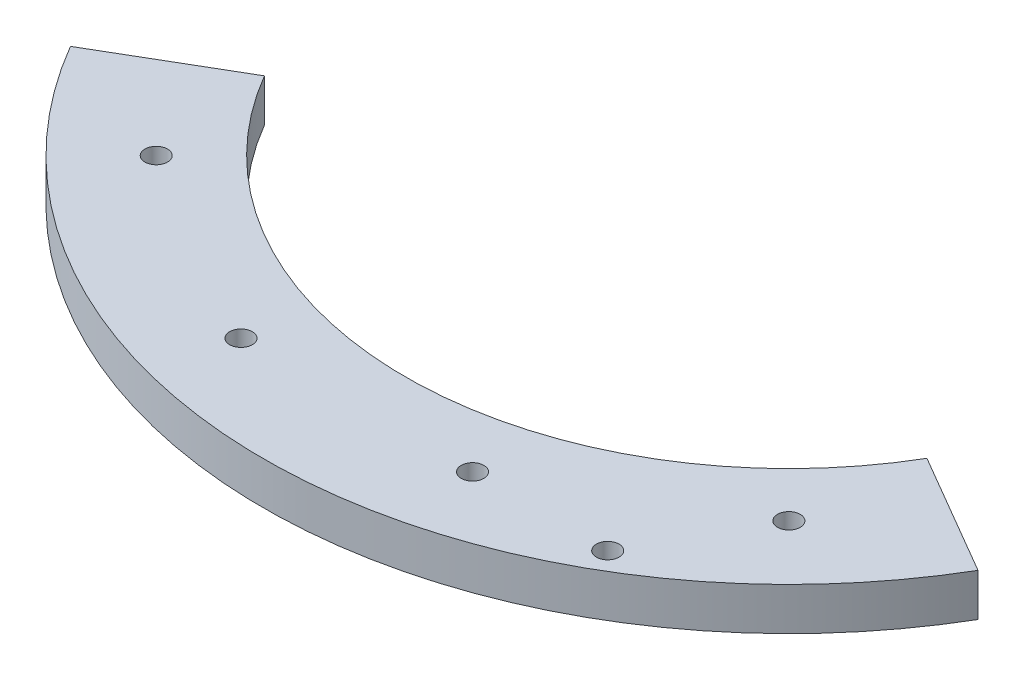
ISO-10303-21;
HEADER;
FILE_DESCRIPTION(('STEP AP214'),'2;1');
FILE_NAME('part.step','',(''),(''),'','','');
FILE_SCHEMA(('AUTOMOTIVE_DESIGN { 1 0 10303 214 1 1 1 1 }'));
ENDSEC;
DATA;
#1=APPLICATION_CONTEXT('core data for automotive mechanical design processes');
#2=APPLICATION_PROTOCOL_DEFINITION('international standard','automotive_design',2000,#1);
#3=PRODUCT_CONTEXT('',#1,'mechanical');
#4=PRODUCT('Part','Part','',(#3));
#5=PRODUCT_RELATED_PRODUCT_CATEGORY('part','',(#4));
#6=PRODUCT_DEFINITION_FORMATION('','',#4);
#7=PRODUCT_DEFINITION_CONTEXT('part definition',#1,'design');
#8=PRODUCT_DEFINITION('design','',#6,#7);
#9=PRODUCT_DEFINITION_SHAPE('','',#8);
#10=(LENGTH_UNIT() NAMED_UNIT(*) SI_UNIT(.MILLI.,.METRE.));
#11=(NAMED_UNIT(*) PLANE_ANGLE_UNIT() SI_UNIT($,.RADIAN.));
#12=(NAMED_UNIT(*) SI_UNIT($,.STERADIAN.) SOLID_ANGLE_UNIT());
#13=UNCERTAINTY_MEASURE_WITH_UNIT(LENGTH_MEASURE(1.E-05),#10,'distance_accuracy_value','');
#14=(GEOMETRIC_REPRESENTATION_CONTEXT(3) GLOBAL_UNCERTAINTY_ASSIGNED_CONTEXT((#13)) GLOBAL_UNIT_ASSIGNED_CONTEXT((#10,
#11,#12)) REPRESENTATION_CONTEXT('',''));
#15=CARTESIAN_POINT('',(0.,0.,0.));
#16=DIRECTION('',(0.,0.,1.));
#17=DIRECTION('',(1.,0.,0.));
#18=AXIS2_PLACEMENT_3D('',#15,#16,#17);
#19=CARTESIAN_POINT('',(0.,0.,0.));
#20=DIRECTION('',(0.,1.,0.));
#21=DIRECTION('',(0.,0.,1.));
#22=AXIS2_PLACEMENT_3D('',#19,#20,#21);
#23=PLANE('',#22);
#24=CARTESIAN_POINT('',(0.,0.,0.));
#25=DIRECTION('',(0.,1.,0.));
#26=DIRECTION('',(0.,0.,1.));
#27=AXIS2_PLACEMENT_3D('',#24,#25,#26);
#28=CIRCLE('',#27,154.051);
#29=CARTESIAN_POINT('',(133.074723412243,0.,77.60688493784));
#30=VERTEX_POINT('',#29);
#31=CARTESIAN_POINT('',(-133.074723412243,0.,77.60688493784));
#32=VERTEX_POINT('',#31);
#33=EDGE_CURVE('E11',#30,#32,#28,.F.);
#34=ORIENTED_EDGE('',*,*,#33,.F.);
#35=DIRECTION('',(-0.863835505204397,0.,-0.503773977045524));
#36=VECTOR('',#35,1.);
#37=CARTESIAN_POINT('',(98.7363982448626,0.,57.5813655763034));
#38=LINE('',#37,#36);
#39=CARTESIAN_POINT('',(135.268865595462,0.,78.8864708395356));
#40=VERTEX_POINT('',#39);
#41=EDGE_CURVE('E116',#40,#30,#38,.T.);
#42=ORIENTED_EDGE('',*,*,#41,.F.);
#43=CARTESIAN_POINT('',(0.,0.,0.));
#44=DIRECTION('',(0.,1.,0.));
#45=DIRECTION('',(0.,0.,1.));
#46=AXIS2_PLACEMENT_3D('',#43,#44,#45);
#47=CIRCLE('',#46,156.591);
#48=CARTESIAN_POINT('',(-135.268865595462,0.,78.8864708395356));
#49=VERTEX_POINT('',#48);
#50=EDGE_CURVE('E103',#49,#40,#47,.T.);
#51=ORIENTED_EDGE('',*,*,#50,.F.);
#52=DIRECTION('',(-0.863835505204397,0.,0.503773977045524));
#53=VECTOR('',#52,1.);
#54=CARTESIAN_POINT('',(-98.7363982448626,0.,57.5813655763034));
#55=LINE('',#54,#53);
#56=EDGE_CURVE('E113',#32,#49,#55,.T.);
#57=ORIENTED_EDGE('',*,*,#56,.F.);
#58=EDGE_LOOP('',(#34,#42,#51,#57));
#59=FACE_BOUND('',#58,.T.);
#60=ADVANCED_FACE('F36',(#59),#23,.F.);
#61=CARTESIAN_POINT('',(0.,12.7,0.));
#62=DIRECTION('',(0.,-1.,0.));
#63=DIRECTION('',(0.,0.,-1.));
#64=AXIS2_PLACEMENT_3D('',#61,#62,#63);
#65=CYLINDRICAL_SURFACE('',#64,156.591);
#66=ORIENTED_EDGE('',*,*,#50,.T.);
#67=DIRECTION('',(0.,-1.,0.));
#68=VECTOR('',#67,1.);
#69=CARTESIAN_POINT('',(135.268865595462,12.7,78.8864708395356));
#70=LINE('',#69,#68);
#71=CARTESIAN_POINT('',(135.268865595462,12.7,78.8864708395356));
#72=VERTEX_POINT('',#71);
#73=EDGE_CURVE('E45',#72,#40,#70,.T.);
#74=ORIENTED_EDGE('',*,*,#73,.F.);
#75=CARTESIAN_POINT('',(0.,12.7,0.));
#76=DIRECTION('',(0.,1.,0.));
#77=DIRECTION('',(0.,0.,1.));
#78=AXIS2_PLACEMENT_3D('',#75,#76,#77);
#79=CIRCLE('',#78,156.591);
#80=CARTESIAN_POINT('',(-135.268865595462,12.7,78.8864708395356));
#81=VERTEX_POINT('',#80);
#82=EDGE_CURVE('E91',#81,#72,#79,.T.);
#83=ORIENTED_EDGE('',*,*,#82,.F.);
#84=DIRECTION('',(0.,-1.,0.));
#85=VECTOR('',#84,1.);
#86=CARTESIAN_POINT('',(-135.268865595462,12.7,78.8864708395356));
#87=LINE('',#86,#85);
#88=EDGE_CURVE('E109',#81,#49,#87,.T.);
#89=ORIENTED_EDGE('',*,*,#88,.T.);
#90=EDGE_LOOP('',(#66,#74,#83,#89));
#91=FACE_BOUND('',#90,.T.);
#92=ADVANCED_FACE('F38',(#91),#65,.T.);
#93=CARTESIAN_POINT('',(98.7363982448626,12.7,57.5813655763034));
#94=DIRECTION('',(-0.503773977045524,0.,0.863835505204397));
#95=DIRECTION('',(0.863835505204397,0.,0.503773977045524));
#96=AXIS2_PLACEMENT_3D('',#93,#94,#95);
#97=PLANE('',#96);
#98=ORIENTED_EDGE('',*,*,#41,.T.);
#99=CARTESIAN_POINT('',(98.7363982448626,0.,57.5813655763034));
#100=VERTEX_POINT('',#99);
#101=EDGE_CURVE('E118',#30,#100,#38,.T.);
#102=ORIENTED_EDGE('',*,*,#101,.T.);
#103=DIRECTION('',(0.,-1.,0.));
#104=VECTOR('',#103,1.);
#105=CARTESIAN_POINT('',(98.7363982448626,12.7,57.5813655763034));
#106=LINE('',#105,#104);
#107=CARTESIAN_POINT('',(98.7363982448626,12.7,57.5813655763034));
#108=VERTEX_POINT('',#107);
#109=EDGE_CURVE('E87',#108,#100,#106,.T.);
#110=ORIENTED_EDGE('',*,*,#109,.F.);
#111=DIRECTION('',(-0.863835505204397,0.,-0.503773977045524));
#112=VECTOR('',#111,1.);
#113=CARTESIAN_POINT('',(98.7363982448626,12.7,57.5813655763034));
#114=LINE('',#113,#112);
#115=EDGE_CURVE('E80',#72,#108,#114,.T.);
#116=ORIENTED_EDGE('',*,*,#115,.F.);
#117=ORIENTED_EDGE('',*,*,#73,.T.);
#118=EDGE_LOOP('',(#98,#102,#110,#116,#117));
#119=FACE_BOUND('',#118,.T.);
#120=ADVANCED_FACE('F83',(#119),#97,.F.);
#121=CARTESIAN_POINT('',(0.,12.7,0.));
#122=DIRECTION('',(0.,-1.,0.));
#123=DIRECTION('',(0.,0.,-1.));
#124=AXIS2_PLACEMENT_3D('',#121,#122,#123);
#125=CYLINDRICAL_SURFACE('',#124,114.3);
#126=CARTESIAN_POINT('',(0.,0.,0.));
#127=DIRECTION('',(0.,-1.,0.));
#128=DIRECTION('',(0.,0.,1.));
#129=AXIS2_PLACEMENT_3D('',#126,#127,#128);
#130=CIRCLE('',#129,114.3);
#131=CARTESIAN_POINT('',(-98.7363982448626,0.,57.5813655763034));
#132=VERTEX_POINT('',#131);
#133=EDGE_CURVE('E114',#100,#132,#130,.T.);
#134=ORIENTED_EDGE('',*,*,#133,.T.);
#135=DIRECTION('',(0.,-1.,0.));
#136=VECTOR('',#135,1.);
#137=CARTESIAN_POINT('',(-98.7363982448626,12.7,57.5813655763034));
#138=LINE('',#137,#136);
#139=CARTESIAN_POINT('',(-98.7363982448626,12.7,57.5813655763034));
#140=VERTEX_POINT('',#139);
#141=EDGE_CURVE('E104',#140,#132,#138,.T.);
#142=ORIENTED_EDGE('',*,*,#141,.F.);
#143=CARTESIAN_POINT('',(0.,12.7,0.));
#144=DIRECTION('',(0.,-1.,0.));
#145=DIRECTION('',(0.,0.,1.));
#146=AXIS2_PLACEMENT_3D('',#143,#144,#145);
#147=CIRCLE('',#146,114.3);
#148=EDGE_CURVE('E90',#108,#140,#147,.T.);
#149=ORIENTED_EDGE('',*,*,#148,.F.);
#150=ORIENTED_EDGE('',*,*,#109,.T.);
#151=EDGE_LOOP('',(#134,#142,#149,#150));
#152=FACE_BOUND('',#151,.T.);
#153=ADVANCED_FACE('F190',(#152),#125,.F.);
#154=CARTESIAN_POINT('',(-98.7363982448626,12.7,57.5813655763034));
#155=DIRECTION('',(0.503773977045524,0.,0.863835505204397));
#156=DIRECTION('',(0.863835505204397,0.,-0.503773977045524));
#157=AXIS2_PLACEMENT_3D('',#154,#155,#156);
#158=PLANE('',#157);
#159=EDGE_CURVE('E100',#132,#32,#55,.T.);
#160=ORIENTED_EDGE('',*,*,#159,.T.);
#161=ORIENTED_EDGE('',*,*,#56,.T.);
#162=ORIENTED_EDGE('',*,*,#88,.F.);
#163=DIRECTION('',(-0.863835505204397,0.,0.503773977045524));
#164=VECTOR('',#163,1.);
#165=CARTESIAN_POINT('',(-98.7363982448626,12.7,57.5813655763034));
#166=LINE('',#165,#164);
#167=EDGE_CURVE('E96',#140,#81,#166,.T.);
#168=ORIENTED_EDGE('',*,*,#167,.F.);
#169=ORIENTED_EDGE('',*,*,#141,.T.);
#170=EDGE_LOOP('',(#160,#161,#162,#168,#169));
#171=FACE_BOUND('',#170,.T.);
#172=ADVANCED_FACE('F158',(#171),#158,.F.);
#173=CARTESIAN_POINT('',(0.,12.7,0.));
#174=DIRECTION('',(0.,1.,0.));
#175=DIRECTION('',(0.,0.,1.));
#176=AXIS2_PLACEMENT_3D('',#173,#174,#175);
#177=PLANE('',#176);
#178=CARTESIAN_POINT('',(-94.2926892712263,12.7,94.2926892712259));
#179=DIRECTION('',(0.,1.,0.));
#180=DIRECTION('',(0.,0.,1.));
#181=AXIS2_PLACEMENT_3D('',#178,#179,#180);
#182=CIRCLE('',#181,3.3782);
#183=CARTESIAN_POINT('',(-94.2926892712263,12.7,97.6708892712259));
#184=VERTEX_POINT('',#183);
#185=EDGE_CURVE('E149',#184,#184,#182,.T.);
#186=ORIENTED_EDGE('',*,*,#185,.F.);
#187=EDGE_LOOP('',(#186));
#188=FACE_BOUND('',#187,.T.);
#189=CARTESIAN_POINT('',(94.2926892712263,12.7,94.2926892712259));
#190=DIRECTION('',(0.,1.,0.));
#191=DIRECTION('',(0.,0.,1.));
#192=AXIS2_PLACEMENT_3D('',#189,#190,#191);
#193=CIRCLE('',#192,3.3782);
#194=CARTESIAN_POINT('',(94.2926892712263,12.7,97.6708892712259));
#195=VERTEX_POINT('',#194);
#196=EDGE_CURVE('E143',#195,#195,#193,.T.);
#197=ORIENTED_EDGE('',*,*,#196,.F.);
#198=EDGE_LOOP('',(#197));
#199=FACE_BOUND('',#198,.T.);
#200=CARTESIAN_POINT('',(-34.5135196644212,12.7,128.806208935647));
#201=DIRECTION('',(0.,1.,0.));
#202=DIRECTION('',(0.,0.,1.));
#203=AXIS2_PLACEMENT_3D('',#200,#201,#202);
#204=CIRCLE('',#203,3.3782);
#205=CARTESIAN_POINT('',(-34.5135196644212,12.7,132.184408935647));
#206=VERTEX_POINT('',#205);
#207=EDGE_CURVE('E137',#206,#206,#204,.T.);
#208=ORIENTED_EDGE('',*,*,#207,.F.);
#209=EDGE_LOOP('',(#208));
#210=FACE_BOUND('',#209,.T.);
#211=CARTESIAN_POINT('',(34.5135196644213,12.7,128.806208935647));
#212=DIRECTION('',(0.,1.,0.));
#213=DIRECTION('',(0.,0.,1.));
#214=AXIS2_PLACEMENT_3D('',#211,#212,#213);
#215=CIRCLE('',#214,3.3782);
#216=CARTESIAN_POINT('',(34.5135196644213,12.7,132.184408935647));
#217=VERTEX_POINT('',#216);
#218=EDGE_CURVE('E131',#217,#217,#215,.T.);
#219=ORIENTED_EDGE('',*,*,#218,.F.);
#220=EDGE_LOOP('',(#219));
#221=FACE_BOUND('',#220,.T.);
#222=CARTESIAN_POINT('',(74.9895331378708,12.7,128.986314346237));
#223=DIRECTION('',(0.,1.,0.));
#224=DIRECTION('',(0.,0.,1.));
#225=AXIS2_PLACEMENT_3D('',#222,#223,#224);
#226=CIRCLE('',#225,3.3782);
#227=CARTESIAN_POINT('',(74.9895331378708,12.7,132.364514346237));
#228=VERTEX_POINT('',#227);
#229=EDGE_CURVE('E125',#228,#228,#226,.T.);
#230=ORIENTED_EDGE('',*,*,#229,.F.);
#231=EDGE_LOOP('',(#230));
#232=FACE_BOUND('',#231,.T.);
#233=ORIENTED_EDGE('',*,*,#82,.T.);
#234=ORIENTED_EDGE('',*,*,#115,.T.);
#235=ORIENTED_EDGE('',*,*,#148,.T.);
#236=ORIENTED_EDGE('',*,*,#167,.T.);
#237=EDGE_LOOP('',(#233,#234,#235,#236));
#238=FACE_BOUND('',#237,.T.);
#239=ADVANCED_FACE('F94',(#188,#199,#210,#221,#232,#238),#177,.T.);
#240=CARTESIAN_POINT('',(-94.2926892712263,0.,94.2926892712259));
#241=DIRECTION('',(0.,1.,0.));
#242=DIRECTION('',(0.,0.,1.));
#243=AXIS2_PLACEMENT_3D('',#240,#241,#242);
#244=CIRCLE('',#243,3.3782);
#245=CARTESIAN_POINT('',(-94.2926892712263,0.,97.6708892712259));
#246=VERTEX_POINT('',#245);
#247=EDGE_CURVE('E146',#246,#246,#244,.T.);
#248=ORIENTED_EDGE('',*,*,#247,.T.);
#249=EDGE_LOOP('',(#248));
#250=FACE_BOUND('',#249,.T.);
#251=CARTESIAN_POINT('',(94.2926892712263,0.,94.2926892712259));
#252=DIRECTION('',(0.,1.,0.));
#253=DIRECTION('',(0.,0.,1.));
#254=AXIS2_PLACEMENT_3D('',#251,#252,#253);
#255=CIRCLE('',#254,3.3782);
#256=CARTESIAN_POINT('',(94.2926892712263,0.,97.6708892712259));
#257=VERTEX_POINT('',#256);
#258=EDGE_CURVE('E140',#257,#257,#255,.T.);
#259=ORIENTED_EDGE('',*,*,#258,.T.);
#260=EDGE_LOOP('',(#259));
#261=FACE_BOUND('',#260,.T.);
#262=CARTESIAN_POINT('',(-34.5135196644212,0.,128.806208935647));
#263=DIRECTION('',(0.,1.,0.));
#264=DIRECTION('',(0.,0.,1.));
#265=AXIS2_PLACEMENT_3D('',#262,#263,#264);
#266=CIRCLE('',#265,3.37819999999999);
#267=CARTESIAN_POINT('',(-34.5135196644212,0.,132.184408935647));
#268=VERTEX_POINT('',#267);
#269=EDGE_CURVE('E134',#268,#268,#266,.T.);
#270=ORIENTED_EDGE('',*,*,#269,.T.);
#271=EDGE_LOOP('',(#270));
#272=FACE_BOUND('',#271,.T.);
#273=CARTESIAN_POINT('',(34.5135196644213,0.,128.806208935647));
#274=DIRECTION('',(0.,1.,0.));
#275=DIRECTION('',(0.,0.,1.));
#276=AXIS2_PLACEMENT_3D('',#273,#274,#275);
#277=CIRCLE('',#276,3.37819999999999);
#278=CARTESIAN_POINT('',(34.5135196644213,0.,132.184408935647));
#279=VERTEX_POINT('',#278);
#280=EDGE_CURVE('E128',#279,#279,#277,.T.);
#281=ORIENTED_EDGE('',*,*,#280,.T.);
#282=EDGE_LOOP('',(#281));
#283=FACE_BOUND('',#282,.T.);
#284=CARTESIAN_POINT('',(74.9895331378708,0.,128.986314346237));
#285=DIRECTION('',(0.,1.,0.));
#286=DIRECTION('',(0.,0.,1.));
#287=AXIS2_PLACEMENT_3D('',#284,#285,#286);
#288=CIRCLE('',#287,3.3782);
#289=CARTESIAN_POINT('',(74.9895331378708,0.,132.364514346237));
#290=VERTEX_POINT('',#289);
#291=EDGE_CURVE('E120',#290,#290,#288,.T.);
#292=ORIENTED_EDGE('',*,*,#291,.T.);
#293=EDGE_LOOP('',(#292));
#294=FACE_BOUND('',#293,.T.);
#295=ORIENTED_EDGE('',*,*,#101,.F.);
#296=ORIENTED_EDGE('',*,*,#33,.T.);
#297=ORIENTED_EDGE('',*,*,#159,.F.);
#298=ORIENTED_EDGE('',*,*,#133,.F.);
#299=EDGE_LOOP('',(#295,#296,#297,#298));
#300=FACE_BOUND('',#299,.T.);
#301=ADVANCED_FACE('F157',(#250,#261,#272,#283,#294,#300),#23,.F.);
#302=CARTESIAN_POINT('',(74.9895331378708,12.7,128.986314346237));
#303=DIRECTION('',(0.,1.,0.));
#304=DIRECTION('',(0.,0.,1.));
#305=AXIS2_PLACEMENT_3D('',#302,#303,#304);
#306=CYLINDRICAL_SURFACE('',#305,3.3782);
#307=ORIENTED_EDGE('',*,*,#291,.F.);
#308=EDGE_LOOP('',(#307));
#309=FACE_BOUND('',#308,.T.);
#310=ORIENTED_EDGE('',*,*,#229,.T.);
#311=EDGE_LOOP('',(#310));
#312=FACE_BOUND('',#311,.T.);
#313=ADVANCED_FACE('F168',(#309,#312),#306,.F.);
#314=CARTESIAN_POINT('',(34.5135196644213,12.7,128.806208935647));
#315=DIRECTION('',(0.,1.,0.));
#316=DIRECTION('',(0.,0.,1.));
#317=AXIS2_PLACEMENT_3D('',#314,#315,#316);
#318=CYLINDRICAL_SURFACE('',#317,3.37819999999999);
#319=ORIENTED_EDGE('',*,*,#280,.F.);
#320=EDGE_LOOP('',(#319));
#321=FACE_BOUND('',#320,.T.);
#322=ORIENTED_EDGE('',*,*,#218,.T.);
#323=EDGE_LOOP('',(#322));
#324=FACE_BOUND('',#323,.T.);
#325=ADVANCED_FACE('F170',(#321,#324),#318,.F.);
#326=CARTESIAN_POINT('',(-34.5135196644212,12.7,128.806208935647));
#327=DIRECTION('',(0.,1.,0.));
#328=DIRECTION('',(0.,0.,1.));
#329=AXIS2_PLACEMENT_3D('',#326,#327,#328);
#330=CYLINDRICAL_SURFACE('',#329,3.3782);
#331=ORIENTED_EDGE('',*,*,#269,.F.);
#332=EDGE_LOOP('',(#331));
#333=FACE_BOUND('',#332,.T.);
#334=ORIENTED_EDGE('',*,*,#207,.T.);
#335=EDGE_LOOP('',(#334));
#336=FACE_BOUND('',#335,.T.);
#337=ADVANCED_FACE('F177',(#333,#336),#330,.F.);
#338=CARTESIAN_POINT('',(94.2926892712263,12.7,94.2926892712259));
#339=DIRECTION('',(0.,1.,0.));
#340=DIRECTION('',(0.,0.,1.));
#341=AXIS2_PLACEMENT_3D('',#338,#339,#340);
#342=CYLINDRICAL_SURFACE('',#341,3.3782);
#343=ORIENTED_EDGE('',*,*,#258,.F.);
#344=EDGE_LOOP('',(#343));
#345=FACE_BOUND('',#344,.T.);
#346=ORIENTED_EDGE('',*,*,#196,.T.);
#347=EDGE_LOOP('',(#346));
#348=FACE_BOUND('',#347,.T.);
#349=ADVANCED_FACE('F235',(#345,#348),#342,.F.);
#350=CARTESIAN_POINT('',(-94.2926892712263,12.7,94.2926892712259));
#351=DIRECTION('',(0.,1.,0.));
#352=DIRECTION('',(0.,0.,1.));
#353=AXIS2_PLACEMENT_3D('',#350,#351,#352);
#354=CYLINDRICAL_SURFACE('',#353,3.3782);
#355=ORIENTED_EDGE('',*,*,#247,.F.);
#356=EDGE_LOOP('',(#355));
#357=FACE_BOUND('',#356,.T.);
#358=ORIENTED_EDGE('',*,*,#185,.T.);
#359=EDGE_LOOP('',(#358));
#360=FACE_BOUND('',#359,.T.);
#361=ADVANCED_FACE('F153',(#357,#360),#354,.F.);
#362=CLOSED_SHELL('',(#60,#92,#120,#153,#172,#239,#301,#313,#325,#337,#349,#361));
#363=MANIFOLD_SOLID_BREP('B2',#362);
#364=ADVANCED_BREP_SHAPE_REPRESENTATION('',(#18,#363),#14);
#365=SHAPE_DEFINITION_REPRESENTATION(#9,#364);
ENDSEC;
END-ISO-10303-21;
